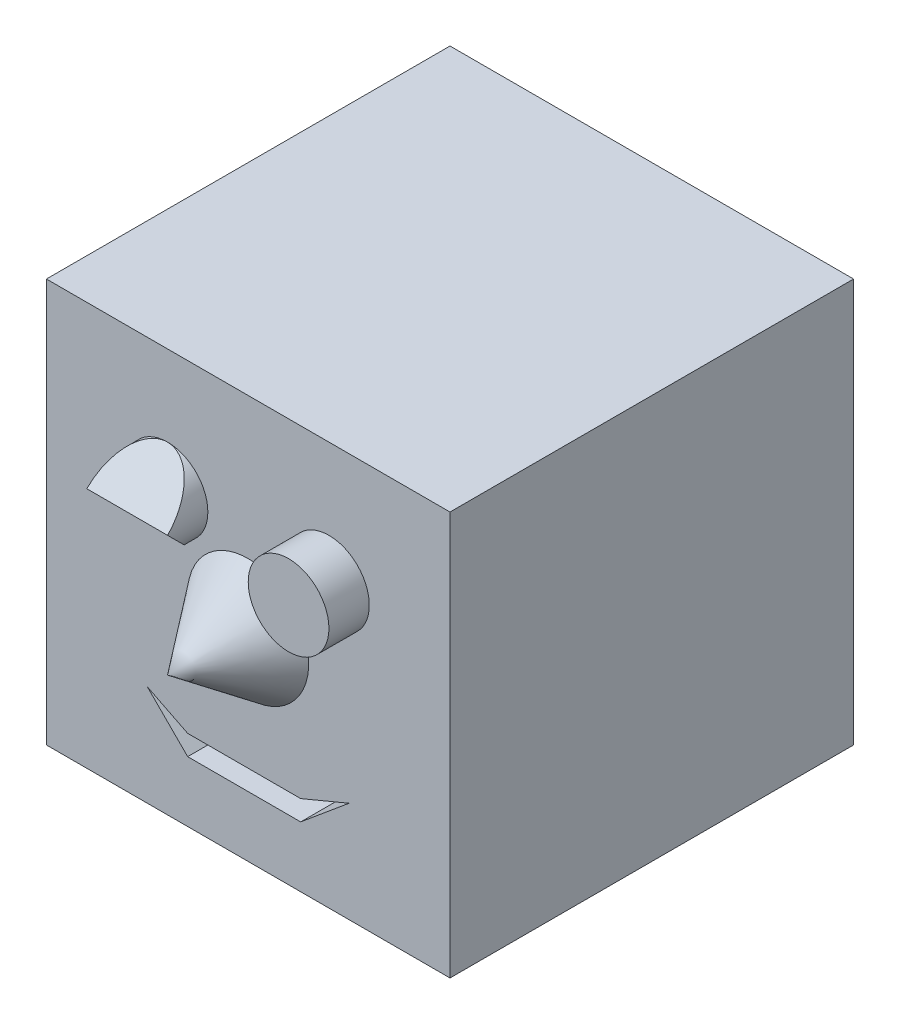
from build123d import *
from build123d.topology import SkipClean

# Parameters (mm, degrees)
SKETCH1_W          = 25
SKETCH1_H          = 25
EXTRUDE1_DEPTH     = 25
SKETCH2_R          = 2.5
EXTRUDE2_DEPTH     = 10
CUT_EXTRUDE1_DEPTH = 44.301270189
SKETCH4_R          = 2.5
EXTRUDE3_DEPTH     = 2.5
CUT_EXTRUDE2_DEPTH = 2.5


with BuildPart() as part:
    # Sketch1 → Extrude1 (new body)
    with BuildSketch(Plane.XY):
        with Locations((12.5, 12.5)):
            Rectangle(SKETCH1_W, SKETCH1_H)
    extrude(amount=-EXTRUDE1_DEPTH)

    # Sketch2 → Extrude2 (add)
    with BuildSketch(Plane.XY):
        with Locations(Location((7.5, 17.5, 0), (0, 0, 180))):
            Circle(SKETCH2_R)
    extrude(amount=EXTRUDE2_DEPTH)

    # Sketch3 → Cut-Extrude1 (cut, through all)
    with SkipClean():  # the faces are left unmerged after this step: merging them gives an invalid solid
        with BuildSketch(Plane.ZY):
            Polygon((0, 20), (12, 20), (12, 15), (0, 15), (2.5, 17.5), align=None)
        extrude(amount=-CUT_EXTRUDE1_DEPTH, mode=Mode.SUBTRACT)

    # Sketch4 → Extrude3 (add)
    with SkipClean():  # the faces are left unmerged after this step: merging them gives an invalid solid
        with BuildSketch(Plane.XY):
            with Locations(Location((17.5, 17.5, 0), (0, 0, 180))):
                Circle(SKETCH4_R)
        extrude(amount=EXTRUDE3_DEPTH)

    # Sketch10 → Cut-Extrude2 (cut)
    with SkipClean():  # the faces are left unmerged after this step: merging them gives an invalid solid
        with BuildSketch(Plane.XY):
            Polygon((6.25, 6.25), (8.75, 5), (15.75, 5), (18.75, 6.25), (15.75, 3.75), (8.75, 3.75), align=None)
        extrude(amount=-CUT_EXTRUDE2_DEPTH, mode=Mode.SUBTRACT)

    # Sketch13 → Revolve1 (revolve)
    with SkipClean():  # the faces are left unmerged after this step: merging them gives an invalid solid
        with BuildSketch(Plane(origin=(12.5, 0, 0), x_dir=(0, 0, -1), z_dir=(1, 0, 0)), mode=Mode.PRIVATE) as revolve1_sk:
            Polygon((0, 12.5), (-5, 12.5), (0, 16.25), align=None)
        revolve(revolve1_sk.sketch.rotate(Axis((12.5, 12.5, 0), (0, 0, 1)), 90), axis=Axis((12.5, 12.5, 0), (0, 0, 1)))


solid = part.part
